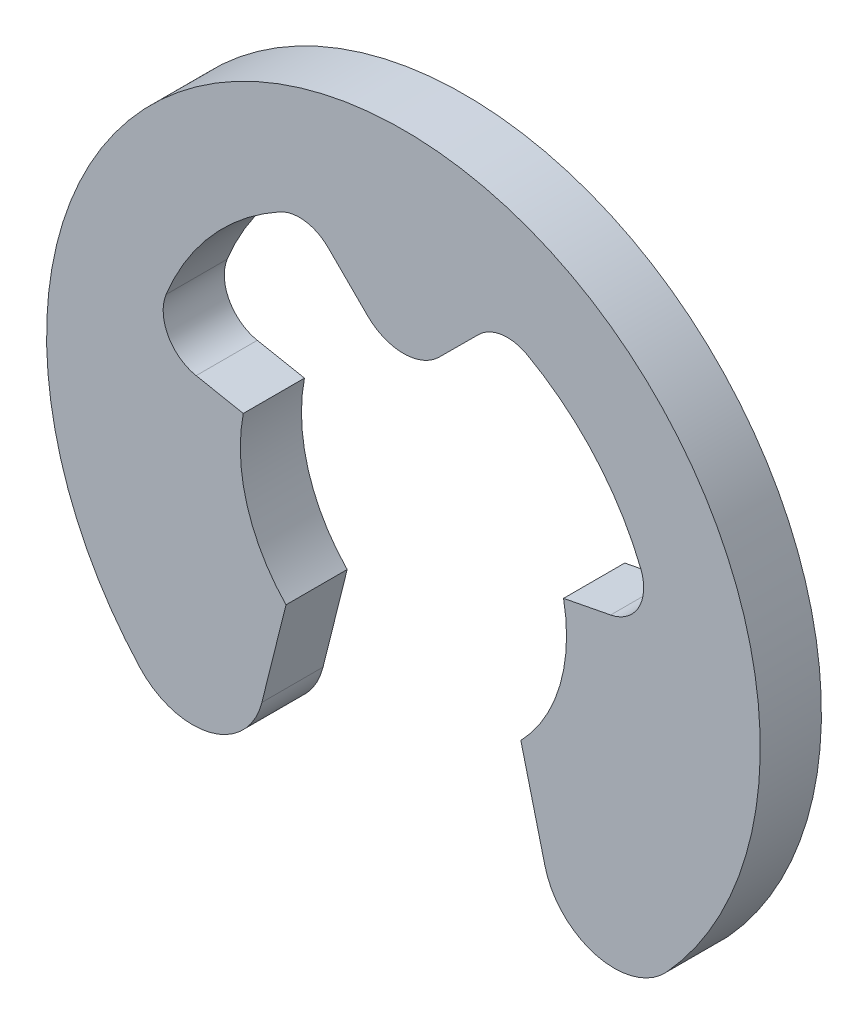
ISO-10303-21;
HEADER;
FILE_DESCRIPTION(('STEP AP214'),'2;1');
FILE_NAME('part.step','',(''),(''),'','','');
FILE_SCHEMA(('AUTOMOTIVE_DESIGN { 1 0 10303 214 1 1 1 1 }'));
ENDSEC;
DATA;
#1=APPLICATION_CONTEXT('core data for automotive mechanical design processes');
#2=APPLICATION_PROTOCOL_DEFINITION('international standard','automotive_design',2000,#1);
#3=PRODUCT_CONTEXT('',#1,'mechanical');
#4=PRODUCT('Part','Part','',(#3));
#5=PRODUCT_RELATED_PRODUCT_CATEGORY('part','',(#4));
#6=PRODUCT_DEFINITION_FORMATION('','',#4);
#7=PRODUCT_DEFINITION_CONTEXT('part definition',#1,'design');
#8=PRODUCT_DEFINITION('design','',#6,#7);
#9=PRODUCT_DEFINITION_SHAPE('','',#8);
#10=(LENGTH_UNIT() NAMED_UNIT(*) SI_UNIT(.MILLI.,.METRE.));
#11=(NAMED_UNIT(*) PLANE_ANGLE_UNIT() SI_UNIT($,.RADIAN.));
#12=(NAMED_UNIT(*) SI_UNIT($,.STERADIAN.) SOLID_ANGLE_UNIT());
#13=UNCERTAINTY_MEASURE_WITH_UNIT(LENGTH_MEASURE(1.E-05),#10,'distance_accuracy_value','');
#14=(GEOMETRIC_REPRESENTATION_CONTEXT(3) GLOBAL_UNCERTAINTY_ASSIGNED_CONTEXT((#13)) GLOBAL_UNIT_ASSIGNED_CONTEXT((#10,
#11,#12)) REPRESENTATION_CONTEXT('',''));
#15=CARTESIAN_POINT('',(0.,0.,0.));
#16=DIRECTION('',(0.,0.,1.));
#17=DIRECTION('',(1.,0.,0.));
#18=AXIS2_PLACEMENT_3D('',#15,#16,#17);
#19=CARTESIAN_POINT('',(-1.95651724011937,0.788144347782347,0.6));
#20=DIRECTION('',(0.,0.,-1.));
#21=DIRECTION('',(-1.,0.,0.));
#22=AXIS2_PLACEMENT_3D('',#19,#20,#21);
#23=CYLINDRICAL_SURFACE('',#22,0.4);
#24=CARTESIAN_POINT('',(-1.95651724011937,0.788144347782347,0.));
#25=DIRECTION('',(0.,0.,-1.));
#26=DIRECTION('',(-1.,0.,0.));
#27=AXIS2_PLACEMENT_3D('',#24,#25,#26);
#28=CIRCLE('',#27,0.4);
#29=CARTESIAN_POINT('',(-2.03290583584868,0.395506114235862,0.));
#30=VERTEX_POINT('',#29);
#31=CARTESIAN_POINT('',(-2.32754470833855,0.937605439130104,0.));
#32=VERTEX_POINT('',#31);
#33=EDGE_CURVE('E189',#30,#32,#28,.T.);
#34=ORIENTED_EDGE('',*,*,#33,.T.);
#35=DIRECTION('',(0.,0.,-1.));
#36=VECTOR('',#35,1.);
#37=CARTESIAN_POINT('',(-2.32754470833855,0.937605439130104,0.6));
#38=LINE('',#37,#36);
#39=CARTESIAN_POINT('',(-2.32754470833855,0.937605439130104,0.6));
#40=VERTEX_POINT('',#39);
#41=EDGE_CURVE('E11',#40,#32,#38,.T.);
#42=ORIENTED_EDGE('',*,*,#41,.F.);
#43=CARTESIAN_POINT('',(-1.95651724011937,0.788144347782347,0.6));
#44=DIRECTION('',(0.,0.,-1.));
#45=DIRECTION('',(-1.,0.,0.));
#46=AXIS2_PLACEMENT_3D('',#43,#44,#45);
#47=CIRCLE('',#46,0.4);
#48=CARTESIAN_POINT('',(-2.03290583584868,0.395506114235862,0.6));
#49=VERTEX_POINT('',#48);
#50=EDGE_CURVE('E223',#49,#40,#47,.T.);
#51=ORIENTED_EDGE('',*,*,#50,.F.);
#52=DIRECTION('',(0.,0.,-1.));
#53=VECTOR('',#52,1.);
#54=CARTESIAN_POINT('',(-2.03290583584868,0.395506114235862,0.6));
#55=LINE('',#54,#53);
#56=EDGE_CURVE('E185',#49,#30,#55,.T.);
#57=ORIENTED_EDGE('',*,*,#56,.T.);
#58=EDGE_LOOP('',(#34,#42,#51,#57));
#59=FACE_BOUND('',#58,.T.);
#60=ADVANCED_FACE('F33',(#59),#23,.F.);
#61=CARTESIAN_POINT('',(0.,0.,0.6));
#62=DIRECTION('',(0.,0.,-1.));
#63=DIRECTION('',(-1.,0.,0.));
#64=AXIS2_PLACEMENT_3D('',#61,#62,#63);
#65=CYLINDRICAL_SURFACE('',#64,2.50929638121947);
#66=CARTESIAN_POINT('',(0.,0.,0.));
#67=DIRECTION('',(0.,0.,-1.));
#68=DIRECTION('',(1.,0.,0.));
#69=AXIS2_PLACEMENT_3D('',#66,#67,#68);
#70=CIRCLE('',#69,2.50929638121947);
#71=CARTESIAN_POINT('',(-1.21323583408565,2.19650338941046,0.));
#72=VERTEX_POINT('',#71);
#73=EDGE_CURVE('E192',#32,#72,#70,.T.);
#74=ORIENTED_EDGE('',*,*,#73,.T.);
#75=DIRECTION('',(0.,0.,-1.));
#76=VECTOR('',#75,1.);
#77=CARTESIAN_POINT('',(-1.21323583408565,2.19650338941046,0.6));
#78=LINE('',#77,#76);
#79=CARTESIAN_POINT('',(-1.21323583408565,2.19650338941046,0.6));
#80=VERTEX_POINT('',#79);
#81=EDGE_CURVE('E41',#80,#72,#78,.T.);
#82=ORIENTED_EDGE('',*,*,#81,.F.);
#83=CARTESIAN_POINT('',(0.,0.,0.6));
#84=DIRECTION('',(0.,0.,-1.));
#85=DIRECTION('',(1.,0.,0.));
#86=AXIS2_PLACEMENT_3D('',#83,#84,#85);
#87=CIRCLE('',#86,2.50929638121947);
#88=EDGE_CURVE('E122',#40,#80,#87,.T.);
#89=ORIENTED_EDGE('',*,*,#88,.F.);
#90=ORIENTED_EDGE('',*,*,#41,.T.);
#91=EDGE_LOOP('',(#74,#82,#89,#90));
#92=FACE_BOUND('',#91,.T.);
#93=ADVANCED_FACE('F331',(#92),#65,.F.);
#94=CARTESIAN_POINT('',(-1.01983726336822,1.84636485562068,0.6));
#95=DIRECTION('',(0.,0.,-1.));
#96=DIRECTION('',(-1.,0.,0.));
#97=AXIS2_PLACEMENT_3D('',#94,#95,#96);
#98=CYLINDRICAL_SURFACE('',#97,0.4);
#99=CARTESIAN_POINT('',(-1.01983726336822,1.84636485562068,0.));
#100=DIRECTION('',(0.,0.,-1.));
#101=DIRECTION('',(1.,0.,0.));
#102=AXIS2_PLACEMENT_3D('',#99,#100,#101);
#103=CIRCLE('',#102,0.4);
#104=CARTESIAN_POINT('',(-0.737506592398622,2.12971868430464,0.));
#105=VERTEX_POINT('',#104);
#106=EDGE_CURVE('E194',#72,#105,#103,.T.);
#107=ORIENTED_EDGE('',*,*,#106,.T.);
#108=DIRECTION('',(0.,0.,-1.));
#109=VECTOR('',#108,1.);
#110=CARTESIAN_POINT('',(-0.737506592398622,2.12971868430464,0.6));
#111=LINE('',#110,#109);
#112=CARTESIAN_POINT('',(-0.737506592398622,2.12971868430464,0.6));
#113=VERTEX_POINT('',#112);
#114=EDGE_CURVE('E260',#113,#105,#111,.T.);
#115=ORIENTED_EDGE('',*,*,#114,.F.);
#116=CARTESIAN_POINT('',(-1.01983726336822,1.84636485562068,0.6));
#117=DIRECTION('',(0.,0.,-1.));
#118=DIRECTION('',(1.,0.,0.));
#119=AXIS2_PLACEMENT_3D('',#116,#117,#118);
#120=CIRCLE('',#119,0.4);
#121=EDGE_CURVE('E268',#80,#113,#120,.T.);
#122=ORIENTED_EDGE('',*,*,#121,.F.);
#123=ORIENTED_EDGE('',*,*,#81,.T.);
#124=EDGE_LOOP('',(#107,#115,#122,#123));
#125=FACE_BOUND('',#124,.T.);
#126=ADVANCED_FACE('F266',(#125),#98,.F.);
#127=CARTESIAN_POINT('',(-0.351702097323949,1.74530728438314,0.6));
#128=DIRECTION('',(0.705826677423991,0.708384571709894,0.));
#129=DIRECTION('',(-0.708384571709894,0.705826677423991,0.));
#130=AXIS2_PLACEMENT_3D('',#127,#128,#129);
#131=PLANE('',#130);
#132=DIRECTION('',(0.708384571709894,-0.70582667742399,0.));
#133=VECTOR('',#132,1.);
#134=CARTESIAN_POINT('',(-0.351702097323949,1.74530728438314,0.));
#135=LINE('',#134,#133);
#136=CARTESIAN_POINT('',(-0.351702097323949,1.74530728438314,0.));
#137=VERTEX_POINT('',#136);
#138=EDGE_CURVE('E196',#105,#137,#135,.T.);
#139=ORIENTED_EDGE('',*,*,#138,.T.);
#140=DIRECTION('',(0.,0.,-1.));
#141=VECTOR('',#140,1.);
#142=CARTESIAN_POINT('',(-0.351702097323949,1.74530728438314,0.6));
#143=LINE('',#142,#141);
#144=CARTESIAN_POINT('',(-0.351702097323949,1.74530728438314,0.6));
#145=VERTEX_POINT('',#144);
#146=EDGE_CURVE('E257',#145,#137,#143,.T.);
#147=ORIENTED_EDGE('',*,*,#146,.F.);
#148=DIRECTION('',(0.708384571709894,-0.70582667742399,0.));
#149=VECTOR('',#148,1.);
#150=CARTESIAN_POINT('',(-0.351702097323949,1.74530728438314,0.6));
#151=LINE('',#150,#149);
#152=EDGE_CURVE('E286',#113,#145,#151,.T.);
#153=ORIENTED_EDGE('',*,*,#152,.F.);
#154=ORIENTED_EDGE('',*,*,#114,.T.);
#155=EDGE_LOOP('',(#139,#147,#153,#154));
#156=FACE_BOUND('',#155,.T.);
#157=ADVANCED_FACE('F277',(#156),#131,.F.);
#158=CARTESIAN_POINT('',(0.,2.0982839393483,0.6));
#159=DIRECTION('',(0.,0.,-1.));
#160=DIRECTION('',(-1.,0.,0.));
#161=AXIS2_PLACEMENT_3D('',#158,#159,#160);
#162=CYLINDRICAL_SURFACE('',#161,0.498283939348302);
#163=CARTESIAN_POINT('',(0.,2.0982839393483,0.));
#164=DIRECTION('',(0.,0.,1.));
#165=DIRECTION('',(1.,0.,0.));
#166=AXIS2_PLACEMENT_3D('',#163,#164,#165);
#167=CIRCLE('',#166,0.498283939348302);
#168=CARTESIAN_POINT('',(0.351702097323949,1.74530728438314,0.));
#169=VERTEX_POINT('',#168);
#170=EDGE_CURVE('E198',#137,#169,#167,.T.);
#171=ORIENTED_EDGE('',*,*,#170,.T.);
#172=DIRECTION('',(0.,0.,-1.));
#173=VECTOR('',#172,1.);
#174=CARTESIAN_POINT('',(0.351702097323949,1.74530728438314,0.6));
#175=LINE('',#174,#173);
#176=CARTESIAN_POINT('',(0.351702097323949,1.74530728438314,0.6));
#177=VERTEX_POINT('',#176);
#178=EDGE_CURVE('E254',#177,#169,#175,.T.);
#179=ORIENTED_EDGE('',*,*,#178,.F.);
#180=CARTESIAN_POINT('',(0.,2.0982839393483,0.6));
#181=DIRECTION('',(0.,0.,1.));
#182=DIRECTION('',(1.,0.,0.));
#183=AXIS2_PLACEMENT_3D('',#180,#181,#182);
#184=CIRCLE('',#183,0.498283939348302);
#185=EDGE_CURVE('E283',#145,#177,#184,.T.);
#186=ORIENTED_EDGE('',*,*,#185,.F.);
#187=ORIENTED_EDGE('',*,*,#146,.T.);
#188=EDGE_LOOP('',(#171,#179,#186,#187));
#189=FACE_BOUND('',#188,.T.);
#190=ADVANCED_FACE('F281',(#189),#162,.T.);
#191=CARTESIAN_POINT('',(0.351702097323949,1.74530728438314,0.6));
#192=DIRECTION('',(-0.705826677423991,0.708384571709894,0.));
#193=DIRECTION('',(-0.708384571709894,-0.705826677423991,0.));
#194=AXIS2_PLACEMENT_3D('',#191,#192,#193);
#195=PLANE('',#194);
#196=DIRECTION('',(0.708384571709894,0.70582667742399,0.));
#197=VECTOR('',#196,1.);
#198=CARTESIAN_POINT('',(0.351702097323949,1.74530728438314,0.));
#199=LINE('',#198,#197);
#200=CARTESIAN_POINT('',(0.737506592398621,2.12971868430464,0.));
#201=VERTEX_POINT('',#200);
#202=EDGE_CURVE('E200',#169,#201,#199,.T.);
#203=ORIENTED_EDGE('',*,*,#202,.T.);
#204=DIRECTION('',(0.,0.,-1.));
#205=VECTOR('',#204,1.);
#206=CARTESIAN_POINT('',(0.737506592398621,2.12971868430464,0.6));
#207=LINE('',#206,#205);
#208=CARTESIAN_POINT('',(0.737506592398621,2.12971868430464,0.6));
#209=VERTEX_POINT('',#208);
#210=EDGE_CURVE('E251',#209,#201,#207,.T.);
#211=ORIENTED_EDGE('',*,*,#210,.F.);
#212=DIRECTION('',(0.708384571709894,0.70582667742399,0.));
#213=VECTOR('',#212,1.);
#214=CARTESIAN_POINT('',(0.351702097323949,1.74530728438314,0.6));
#215=LINE('',#214,#213);
#216=EDGE_CURVE('E285',#177,#209,#215,.T.);
#217=ORIENTED_EDGE('',*,*,#216,.F.);
#218=ORIENTED_EDGE('',*,*,#178,.T.);
#219=EDGE_LOOP('',(#203,#211,#217,#218));
#220=FACE_BOUND('',#219,.T.);
#221=ADVANCED_FACE('F344',(#220),#195,.F.);
#222=CARTESIAN_POINT('',(1.01983726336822,1.84636485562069,0.6));
#223=DIRECTION('',(0.,0.,-1.));
#224=DIRECTION('',(-1.,0.,0.));
#225=AXIS2_PLACEMENT_3D('',#222,#223,#224);
#226=CYLINDRICAL_SURFACE('',#225,0.4);
#227=CARTESIAN_POINT('',(1.01983726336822,1.84636485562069,0.));
#228=DIRECTION('',(0.,0.,-1.));
#229=DIRECTION('',(-1.,0.,0.));
#230=AXIS2_PLACEMENT_3D('',#227,#228,#229);
#231=CIRCLE('',#230,0.4);
#232=CARTESIAN_POINT('',(1.21323583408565,2.19650338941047,0.));
#233=VERTEX_POINT('',#232);
#234=EDGE_CURVE('E202',#201,#233,#231,.T.);
#235=ORIENTED_EDGE('',*,*,#234,.T.);
#236=DIRECTION('',(0.,0.,-1.));
#237=VECTOR('',#236,1.);
#238=CARTESIAN_POINT('',(1.21323583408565,2.19650338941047,0.6));
#239=LINE('',#238,#237);
#240=CARTESIAN_POINT('',(1.21323583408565,2.19650338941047,0.6));
#241=VERTEX_POINT('',#240);
#242=EDGE_CURVE('E248',#241,#233,#239,.T.);
#243=ORIENTED_EDGE('',*,*,#242,.F.);
#244=CARTESIAN_POINT('',(1.01983726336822,1.84636485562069,0.6));
#245=DIRECTION('',(0.,0.,-1.));
#246=DIRECTION('',(-1.,0.,0.));
#247=AXIS2_PLACEMENT_3D('',#244,#245,#246);
#248=CIRCLE('',#247,0.4);
#249=EDGE_CURVE('E288',#209,#241,#248,.T.);
#250=ORIENTED_EDGE('',*,*,#249,.F.);
#251=ORIENTED_EDGE('',*,*,#210,.T.);
#252=EDGE_LOOP('',(#235,#243,#250,#251));
#253=FACE_BOUND('',#252,.T.);
#254=ADVANCED_FACE('F347',(#253),#226,.F.);
#255=CARTESIAN_POINT('',(0.,0.,0.6));
#256=DIRECTION('',(0.,0.,-1.));
#257=DIRECTION('',(-1.,0.,0.));
#258=AXIS2_PLACEMENT_3D('',#255,#256,#257);
#259=CYLINDRICAL_SURFACE('',#258,2.50929638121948);
#260=CARTESIAN_POINT('',(0.,0.,0.));
#261=DIRECTION('',(0.,0.,-1.));
#262=DIRECTION('',(-1.,0.,0.));
#263=AXIS2_PLACEMENT_3D('',#260,#261,#262);
#264=CIRCLE('',#263,2.50929638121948);
#265=CARTESIAN_POINT('',(2.32754470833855,0.937605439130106,0.));
#266=VERTEX_POINT('',#265);
#267=EDGE_CURVE('E204',#233,#266,#264,.T.);
#268=ORIENTED_EDGE('',*,*,#267,.T.);
#269=DIRECTION('',(0.,0.,-1.));
#270=VECTOR('',#269,1.);
#271=CARTESIAN_POINT('',(2.32754470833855,0.937605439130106,0.6));
#272=LINE('',#271,#270);
#273=CARTESIAN_POINT('',(2.32754470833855,0.937605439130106,0.6));
#274=VERTEX_POINT('',#273);
#275=EDGE_CURVE('E245',#274,#266,#272,.T.);
#276=ORIENTED_EDGE('',*,*,#275,.F.);
#277=CARTESIAN_POINT('',(0.,0.,0.6));
#278=DIRECTION('',(0.,0.,-1.));
#279=DIRECTION('',(-1.,0.,0.));
#280=AXIS2_PLACEMENT_3D('',#277,#278,#279);
#281=CIRCLE('',#280,2.50929638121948);
#282=EDGE_CURVE('E294',#241,#274,#281,.T.);
#283=ORIENTED_EDGE('',*,*,#282,.F.);
#284=ORIENTED_EDGE('',*,*,#242,.T.);
#285=EDGE_LOOP('',(#268,#276,#283,#284));
#286=FACE_BOUND('',#285,.T.);
#287=ADVANCED_FACE('F351',(#286),#259,.F.);
#288=CARTESIAN_POINT('',(1.95651724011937,0.788144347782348,0.6));
#289=DIRECTION('',(0.,0.,-1.));
#290=DIRECTION('',(-1.,0.,0.));
#291=AXIS2_PLACEMENT_3D('',#288,#289,#290);
#292=CYLINDRICAL_SURFACE('',#291,0.4);
#293=CARTESIAN_POINT('',(1.95651724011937,0.788144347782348,0.));
#294=DIRECTION('',(0.,0.,-1.));
#295=DIRECTION('',(1.,0.,0.));
#296=AXIS2_PLACEMENT_3D('',#293,#294,#295);
#297=CIRCLE('',#296,0.4);
#298=CARTESIAN_POINT('',(2.03290583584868,0.395506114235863,0.));
#299=VERTEX_POINT('',#298);
#300=EDGE_CURVE('E206',#266,#299,#297,.T.);
#301=ORIENTED_EDGE('',*,*,#300,.T.);
#302=DIRECTION('',(0.,0.,-1.));
#303=VECTOR('',#302,1.);
#304=CARTESIAN_POINT('',(2.03290583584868,0.395506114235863,0.6));
#305=LINE('',#304,#303);
#306=CARTESIAN_POINT('',(2.03290583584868,0.395506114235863,0.6));
#307=VERTEX_POINT('',#306);
#308=EDGE_CURVE('E242',#307,#299,#305,.T.);
#309=ORIENTED_EDGE('',*,*,#308,.F.);
#310=CARTESIAN_POINT('',(1.95651724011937,0.788144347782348,0.6));
#311=DIRECTION('',(0.,0.,-1.));
#312=DIRECTION('',(1.,0.,0.));
#313=AXIS2_PLACEMENT_3D('',#310,#311,#312);
#314=CIRCLE('',#313,0.4);
#315=EDGE_CURVE('E296',#274,#307,#314,.T.);
#316=ORIENTED_EDGE('',*,*,#315,.F.);
#317=ORIENTED_EDGE('',*,*,#275,.T.);
#318=EDGE_LOOP('',(#301,#309,#316,#317));
#319=FACE_BOUND('',#318,.T.);
#320=ADVANCED_FACE('F355',(#319),#292,.F.);
#321=CARTESIAN_POINT('',(1.57055293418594,0.305554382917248,0.6));
#322=DIRECTION('',(0.190971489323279,-0.981595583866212,0.));
#323=DIRECTION('',(0.981595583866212,0.190971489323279,0.));
#324=AXIS2_PLACEMENT_3D('',#321,#322,#323);
#325=PLANE('',#324);
#326=DIRECTION('',(-0.981595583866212,-0.190971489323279,0.));
#327=VECTOR('',#326,1.);
#328=CARTESIAN_POINT('',(1.57055293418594,0.305554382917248,0.));
#329=LINE('',#328,#327);
#330=CARTESIAN_POINT('',(1.57055293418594,0.305554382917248,0.));
#331=VERTEX_POINT('',#330);
#332=EDGE_CURVE('E208',#299,#331,#329,.T.);
#333=ORIENTED_EDGE('',*,*,#332,.T.);
#334=DIRECTION('',(0.,0.,-1.));
#335=VECTOR('',#334,1.);
#336=CARTESIAN_POINT('',(1.57055293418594,0.305554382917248,0.6));
#337=LINE('',#336,#335);
#338=CARTESIAN_POINT('',(1.57055293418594,0.305554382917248,0.6));
#339=VERTEX_POINT('',#338);
#340=EDGE_CURVE('E239',#339,#331,#337,.T.);
#341=ORIENTED_EDGE('',*,*,#340,.F.);
#342=DIRECTION('',(-0.981595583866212,-0.190971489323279,0.));
#343=VECTOR('',#342,1.);
#344=CARTESIAN_POINT('',(1.57055293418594,0.305554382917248,0.6));
#345=LINE('',#344,#343);
#346=EDGE_CURVE('E298',#307,#339,#345,.T.);
#347=ORIENTED_EDGE('',*,*,#346,.F.);
#348=ORIENTED_EDGE('',*,*,#308,.T.);
#349=EDGE_LOOP('',(#333,#341,#347,#348));
#350=FACE_BOUND('',#349,.T.);
#351=ADVANCED_FACE('F359',(#350),#325,.F.);
#352=CARTESIAN_POINT('',(0.,0.,0.6));
#353=DIRECTION('',(0.,0.,-1.));
#354=DIRECTION('',(-1.,0.,0.));
#355=AXIS2_PLACEMENT_3D('',#352,#353,#354);
#356=CYLINDRICAL_SURFACE('',#355,1.6);
#357=CARTESIAN_POINT('',(0.,0.,0.));
#358=DIRECTION('',(0.,0.,-1.));
#359=DIRECTION('',(-1.,0.,0.));
#360=AXIS2_PLACEMENT_3D('',#357,#358,#359);
#361=CIRCLE('',#360,1.6);
#362=CARTESIAN_POINT('',(1.15166914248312,-1.11070166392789,0.));
#363=VERTEX_POINT('',#362);
#364=EDGE_CURVE('E210',#331,#363,#361,.T.);
#365=ORIENTED_EDGE('',*,*,#364,.T.);
#366=DIRECTION('',(0.,0.,-1.));
#367=VECTOR('',#366,1.);
#368=CARTESIAN_POINT('',(1.15166914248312,-1.11070166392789,0.6));
#369=LINE('',#368,#367);
#370=CARTESIAN_POINT('',(1.15166914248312,-1.11070166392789,0.6));
#371=VERTEX_POINT('',#370);
#372=EDGE_CURVE('E236',#371,#363,#369,.T.);
#373=ORIENTED_EDGE('',*,*,#372,.F.);
#374=CARTESIAN_POINT('',(0.,0.,0.6));
#375=DIRECTION('',(0.,0.,-1.));
#376=DIRECTION('',(-1.,0.,0.));
#377=AXIS2_PLACEMENT_3D('',#374,#375,#376);
#378=CIRCLE('',#377,1.6);
#379=EDGE_CURVE('E300',#339,#371,#378,.T.);
#380=ORIENTED_EDGE('',*,*,#379,.F.);
#381=ORIENTED_EDGE('',*,*,#340,.T.);
#382=EDGE_LOOP('',(#365,#373,#380,#381));
#383=FACE_BOUND('',#382,.T.);
#384=ADVANCED_FACE('F363',(#383),#356,.F.);
#385=CARTESIAN_POINT('',(1.15166914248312,-1.11070166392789,0.6));
#386=DIRECTION('',(0.970192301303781,0.24233633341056,0.));
#387=DIRECTION('',(-0.24233633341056,0.970192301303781,0.));
#388=AXIS2_PLACEMENT_3D('',#385,#386,#387);
#389=PLANE('',#388);
#390=DIRECTION('',(0.24233633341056,-0.970192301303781,0.));
#391=VECTOR('',#390,1.);
#392=CARTESIAN_POINT('',(1.15166914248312,-1.11070166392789,0.));
#393=LINE('',#392,#391);
#394=CARTESIAN_POINT('',(1.38827904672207,-2.05796823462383,0.));
#395=VERTEX_POINT('',#394);
#396=EDGE_CURVE('E212',#363,#395,#393,.T.);
#397=ORIENTED_EDGE('',*,*,#396,.T.);
#398=DIRECTION('',(0.,0.,-1.));
#399=VECTOR('',#398,1.);
#400=CARTESIAN_POINT('',(1.38827904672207,-2.05796823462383,0.6));
#401=LINE('',#400,#399);
#402=CARTESIAN_POINT('',(1.38827904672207,-2.05796823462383,0.6));
#403=VERTEX_POINT('',#402);
#404=EDGE_CURVE('E233',#403,#395,#401,.T.);
#405=ORIENTED_EDGE('',*,*,#404,.F.);
#406=DIRECTION('',(0.24233633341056,-0.970192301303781,0.));
#407=VECTOR('',#406,1.);
#408=CARTESIAN_POINT('',(1.15166914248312,-1.11070166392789,0.6));
#409=LINE('',#408,#407);
#410=EDGE_CURVE('E302',#371,#403,#409,.T.);
#411=ORIENTED_EDGE('',*,*,#410,.F.);
#412=ORIENTED_EDGE('',*,*,#372,.T.);
#413=EDGE_LOOP('',(#397,#405,#411,#412));
#414=FACE_BOUND('',#413,.T.);
#415=ADVANCED_FACE('F367',(#414),#389,.F.);
#416=CARTESIAN_POINT('',(2.06741365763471,-1.88833280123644,0.6));
#417=DIRECTION('',(0.,0.,-1.));
#418=DIRECTION('',(-1.,0.,0.));
#419=AXIS2_PLACEMENT_3D('',#416,#417,#418);
#420=CYLINDRICAL_SURFACE('',#419,0.7);
#421=CARTESIAN_POINT('',(2.06741365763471,-1.88833280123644,0.));
#422=DIRECTION('',(0.,0.,1.));
#423=DIRECTION('',(-1.,0.,0.));
#424=AXIS2_PLACEMENT_3D('',#421,#422,#423);
#425=CIRCLE('',#424,0.7);
#426=CARTESIAN_POINT('',(2.58426707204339,-2.36041600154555,0.));
#427=VERTEX_POINT('',#426);
#428=EDGE_CURVE('E214',#395,#427,#425,.T.);
#429=ORIENTED_EDGE('',*,*,#428,.T.);
#430=DIRECTION('',(0.,0.,-1.));
#431=VECTOR('',#430,1.);
#432=CARTESIAN_POINT('',(2.58426707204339,-2.36041600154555,0.6));
#433=LINE('',#432,#431);
#434=CARTESIAN_POINT('',(2.58426707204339,-2.36041600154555,0.6));
#435=VERTEX_POINT('',#434);
#436=EDGE_CURVE('E230',#435,#427,#433,.T.);
#437=ORIENTED_EDGE('',*,*,#436,.F.);
#438=CARTESIAN_POINT('',(2.06741365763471,-1.88833280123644,0.6));
#439=DIRECTION('',(0.,0.,1.));
#440=DIRECTION('',(-1.,0.,0.));
#441=AXIS2_PLACEMENT_3D('',#438,#439,#440);
#442=CIRCLE('',#441,0.7);
#443=EDGE_CURVE('E304',#403,#435,#442,.T.);
#444=ORIENTED_EDGE('',*,*,#443,.F.);
#445=ORIENTED_EDGE('',*,*,#404,.T.);
#446=EDGE_LOOP('',(#429,#437,#444,#445));
#447=FACE_BOUND('',#446,.T.);
#448=ADVANCED_FACE('F371',(#447),#420,.T.);
#449=CARTESIAN_POINT('',(0.,0.,0.6));
#450=DIRECTION('',(0.,0.,-1.));
#451=DIRECTION('',(-1.,0.,0.));
#452=AXIS2_PLACEMENT_3D('',#449,#450,#451);
#453=CYLINDRICAL_SURFACE('',#452,3.5);
#454=CARTESIAN_POINT('',(0.,0.,0.));
#455=DIRECTION('',(0.,0.,1.));
#456=DIRECTION('',(1.,0.,0.));
#457=AXIS2_PLACEMENT_3D('',#454,#455,#456);
#458=CIRCLE('',#457,3.5);
#459=CARTESIAN_POINT('',(-2.58426707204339,-2.36041600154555,0.));
#460=VERTEX_POINT('',#459);
#461=EDGE_CURVE('E216',#427,#460,#458,.T.);
#462=ORIENTED_EDGE('',*,*,#461,.T.);
#463=DIRECTION('',(0.,0.,-1.));
#464=VECTOR('',#463,1.);
#465=CARTESIAN_POINT('',(-2.58426707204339,-2.36041600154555,0.6));
#466=LINE('',#465,#464);
#467=CARTESIAN_POINT('',(-2.58426707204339,-2.36041600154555,0.6));
#468=VERTEX_POINT('',#467);
#469=EDGE_CURVE('E227',#468,#460,#466,.T.);
#470=ORIENTED_EDGE('',*,*,#469,.F.);
#471=CARTESIAN_POINT('',(0.,0.,0.6));
#472=DIRECTION('',(0.,0.,1.));
#473=DIRECTION('',(1.,0.,0.));
#474=AXIS2_PLACEMENT_3D('',#471,#472,#473);
#475=CIRCLE('',#474,3.5);
#476=EDGE_CURVE('E306',#435,#468,#475,.T.);
#477=ORIENTED_EDGE('',*,*,#476,.F.);
#478=ORIENTED_EDGE('',*,*,#436,.T.);
#479=EDGE_LOOP('',(#462,#470,#477,#478));
#480=FACE_BOUND('',#479,.T.);
#481=ADVANCED_FACE('F312',(#480),#453,.T.);
#482=CARTESIAN_POINT('',(-2.06741365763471,-1.88833280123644,0.6));
#483=DIRECTION('',(0.,0.,-1.));
#484=DIRECTION('',(-1.,0.,0.));
#485=AXIS2_PLACEMENT_3D('',#482,#483,#484);
#486=CYLINDRICAL_SURFACE('',#485,0.7);
#487=CARTESIAN_POINT('',(-2.06741365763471,-1.88833280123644,0.));
#488=DIRECTION('',(0.,0.,1.));
#489=DIRECTION('',(1.,0.,0.));
#490=AXIS2_PLACEMENT_3D('',#487,#488,#489);
#491=CIRCLE('',#490,0.7);
#492=CARTESIAN_POINT('',(-1.38827904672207,-2.05796823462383,0.));
#493=VERTEX_POINT('',#492);
#494=EDGE_CURVE('E218',#460,#493,#491,.T.);
#495=ORIENTED_EDGE('',*,*,#494,.T.);
#496=DIRECTION('',(0.,0.,-1.));
#497=VECTOR('',#496,1.);
#498=CARTESIAN_POINT('',(-1.38827904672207,-2.05796823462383,0.6));
#499=LINE('',#498,#497);
#500=CARTESIAN_POINT('',(-1.38827904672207,-2.05796823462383,0.6));
#501=VERTEX_POINT('',#500);
#502=EDGE_CURVE('E180',#501,#493,#499,.T.);
#503=ORIENTED_EDGE('',*,*,#502,.F.);
#504=CARTESIAN_POINT('',(-2.06741365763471,-1.88833280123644,0.6));
#505=DIRECTION('',(0.,0.,1.));
#506=DIRECTION('',(1.,0.,0.));
#507=AXIS2_PLACEMENT_3D('',#504,#505,#506);
#508=CIRCLE('',#507,0.7);
#509=EDGE_CURVE('E171',#468,#501,#508,.T.);
#510=ORIENTED_EDGE('',*,*,#509,.F.);
#511=ORIENTED_EDGE('',*,*,#469,.T.);
#512=EDGE_LOOP('',(#495,#503,#510,#511));
#513=FACE_BOUND('',#512,.T.);
#514=ADVANCED_FACE('F316',(#513),#486,.T.);
#515=CARTESIAN_POINT('',(-1.15166914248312,-1.11070166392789,0.6));
#516=DIRECTION('',(-0.970192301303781,0.24233633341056,0.));
#517=DIRECTION('',(-0.24233633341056,-0.970192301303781,0.));
#518=AXIS2_PLACEMENT_3D('',#515,#516,#517);
#519=PLANE('',#518);
#520=DIRECTION('',(0.24233633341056,0.970192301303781,0.));
#521=VECTOR('',#520,1.);
#522=CARTESIAN_POINT('',(-1.15166914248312,-1.11070166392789,0.));
#523=LINE('',#522,#521);
#524=CARTESIAN_POINT('',(-1.15166914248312,-1.11070166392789,0.));
#525=VERTEX_POINT('',#524);
#526=EDGE_CURVE('E179',#493,#525,#523,.T.);
#527=ORIENTED_EDGE('',*,*,#526,.T.);
#528=DIRECTION('',(0.,0.,-1.));
#529=VECTOR('',#528,1.);
#530=CARTESIAN_POINT('',(-1.15166914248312,-1.11070166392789,0.6));
#531=LINE('',#530,#529);
#532=CARTESIAN_POINT('',(-1.15166914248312,-1.11070166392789,0.6));
#533=VERTEX_POINT('',#532);
#534=EDGE_CURVE('E176',#533,#525,#531,.T.);
#535=ORIENTED_EDGE('',*,*,#534,.F.);
#536=DIRECTION('',(0.24233633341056,0.970192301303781,0.));
#537=VECTOR('',#536,1.);
#538=CARTESIAN_POINT('',(-1.15166914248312,-1.11070166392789,0.6));
#539=LINE('',#538,#537);
#540=EDGE_CURVE('E165',#501,#533,#539,.T.);
#541=ORIENTED_EDGE('',*,*,#540,.F.);
#542=ORIENTED_EDGE('',*,*,#502,.T.);
#543=EDGE_LOOP('',(#527,#535,#541,#542));
#544=FACE_BOUND('',#543,.T.);
#545=ADVANCED_FACE('F177',(#544),#519,.F.);
#546=CARTESIAN_POINT('',(0.,0.,0.6));
#547=DIRECTION('',(0.,0.,-1.));
#548=DIRECTION('',(-1.,0.,0.));
#549=AXIS2_PLACEMENT_3D('',#546,#547,#548);
#550=CYLINDRICAL_SURFACE('',#549,1.6);
#551=CARTESIAN_POINT('',(0.,0.,0.));
#552=DIRECTION('',(0.,0.,-1.));
#553=DIRECTION('',(1.,0.,0.));
#554=AXIS2_PLACEMENT_3D('',#551,#552,#553);
#555=CIRCLE('',#554,1.6);
#556=CARTESIAN_POINT('',(-1.57055293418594,0.305554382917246,0.));
#557=VERTEX_POINT('',#556);
#558=EDGE_CURVE('E108',#525,#557,#555,.T.);
#559=ORIENTED_EDGE('',*,*,#558,.T.);
#560=DIRECTION('',(0.,0.,-1.));
#561=VECTOR('',#560,1.);
#562=CARTESIAN_POINT('',(-1.57055293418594,0.305554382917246,0.6));
#563=LINE('',#562,#561);
#564=CARTESIAN_POINT('',(-1.57055293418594,0.305554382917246,0.6));
#565=VERTEX_POINT('',#564);
#566=EDGE_CURVE('E181',#565,#557,#563,.T.);
#567=ORIENTED_EDGE('',*,*,#566,.F.);
#568=CARTESIAN_POINT('',(0.,0.,0.6));
#569=DIRECTION('',(0.,0.,-1.));
#570=DIRECTION('',(1.,0.,0.));
#571=AXIS2_PLACEMENT_3D('',#568,#569,#570);
#572=CIRCLE('',#571,1.6);
#573=EDGE_CURVE('E169',#533,#565,#572,.T.);
#574=ORIENTED_EDGE('',*,*,#573,.F.);
#575=ORIENTED_EDGE('',*,*,#534,.T.);
#576=EDGE_LOOP('',(#559,#567,#574,#575));
#577=FACE_BOUND('',#576,.T.);
#578=ADVANCED_FACE('F183',(#577),#550,.F.);
#579=CARTESIAN_POINT('',(-1.57055293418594,0.305554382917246,0.6));
#580=DIRECTION('',(-0.190971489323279,-0.981595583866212,0.));
#581=DIRECTION('',(0.981595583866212,-0.190971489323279,0.));
#582=AXIS2_PLACEMENT_3D('',#579,#580,#581);
#583=PLANE('',#582);
#584=DIRECTION('',(-0.981595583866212,0.190971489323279,0.));
#585=VECTOR('',#584,1.);
#586=CARTESIAN_POINT('',(-1.57055293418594,0.305554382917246,0.));
#587=LINE('',#586,#585);
#588=EDGE_CURVE('E114',#557,#30,#587,.T.);
#589=ORIENTED_EDGE('',*,*,#588,.T.);
#590=ORIENTED_EDGE('',*,*,#56,.F.);
#591=DIRECTION('',(-0.981595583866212,0.190971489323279,0.));
#592=VECTOR('',#591,1.);
#593=CARTESIAN_POINT('',(-1.57055293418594,0.305554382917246,0.6));
#594=LINE('',#593,#592);
#595=EDGE_CURVE('E49',#565,#49,#594,.T.);
#596=ORIENTED_EDGE('',*,*,#595,.F.);
#597=ORIENTED_EDGE('',*,*,#566,.T.);
#598=EDGE_LOOP('',(#589,#590,#596,#597));
#599=FACE_BOUND('',#598,.T.);
#600=ADVANCED_FACE('F320',(#599),#583,.F.);
#601=CARTESIAN_POINT('',(-1.95651724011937,0.788144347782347,0.6));
#602=DIRECTION('',(0.,0.,-1.));
#603=DIRECTION('',(-1.,0.,0.));
#604=AXIS2_PLACEMENT_3D('',#601,#602,#603);
#605=PLANE('',#604);
#606=ORIENTED_EDGE('',*,*,#50,.T.);
#607=ORIENTED_EDGE('',*,*,#88,.T.);
#608=ORIENTED_EDGE('',*,*,#121,.T.);
#609=ORIENTED_EDGE('',*,*,#152,.T.);
#610=ORIENTED_EDGE('',*,*,#185,.T.);
#611=ORIENTED_EDGE('',*,*,#216,.T.);
#612=ORIENTED_EDGE('',*,*,#249,.T.);
#613=ORIENTED_EDGE('',*,*,#282,.T.);
#614=ORIENTED_EDGE('',*,*,#315,.T.);
#615=ORIENTED_EDGE('',*,*,#346,.T.);
#616=ORIENTED_EDGE('',*,*,#379,.T.);
#617=ORIENTED_EDGE('',*,*,#410,.T.);
#618=ORIENTED_EDGE('',*,*,#443,.T.);
#619=ORIENTED_EDGE('',*,*,#476,.T.);
#620=ORIENTED_EDGE('',*,*,#509,.T.);
#621=ORIENTED_EDGE('',*,*,#540,.T.);
#622=ORIENTED_EDGE('',*,*,#573,.T.);
#623=ORIENTED_EDGE('',*,*,#595,.T.);
#624=EDGE_LOOP('',(#606,#607,#608,#609,#610,#611,#612,#613,#614,#615,#616,#617,#618,#619,#620,
#621,#622,#623));
#625=FACE_BOUND('',#624,.T.);
#626=ADVANCED_FACE('F167',(#625),#605,.F.);
#627=CARTESIAN_POINT('',(-1.95651724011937,0.788144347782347,0.));
#628=DIRECTION('',(0.,0.,-1.));
#629=DIRECTION('',(-1.,0.,0.));
#630=AXIS2_PLACEMENT_3D('',#627,#628,#629);
#631=PLANE('',#630);
#632=ORIENTED_EDGE('',*,*,#33,.F.);
#633=ORIENTED_EDGE('',*,*,#588,.F.);
#634=ORIENTED_EDGE('',*,*,#558,.F.);
#635=ORIENTED_EDGE('',*,*,#526,.F.);
#636=ORIENTED_EDGE('',*,*,#494,.F.);
#637=ORIENTED_EDGE('',*,*,#461,.F.);
#638=ORIENTED_EDGE('',*,*,#428,.F.);
#639=ORIENTED_EDGE('',*,*,#396,.F.);
#640=ORIENTED_EDGE('',*,*,#364,.F.);
#641=ORIENTED_EDGE('',*,*,#332,.F.);
#642=ORIENTED_EDGE('',*,*,#300,.F.);
#643=ORIENTED_EDGE('',*,*,#267,.F.);
#644=ORIENTED_EDGE('',*,*,#234,.F.);
#645=ORIENTED_EDGE('',*,*,#202,.F.);
#646=ORIENTED_EDGE('',*,*,#170,.F.);
#647=ORIENTED_EDGE('',*,*,#138,.F.);
#648=ORIENTED_EDGE('',*,*,#106,.F.);
#649=ORIENTED_EDGE('',*,*,#73,.F.);
#650=EDGE_LOOP('',(#632,#633,#634,#635,#636,#637,#638,#639,#640,#641,#642,#643,#644,#645,#646,
#647,#648,#649));
#651=FACE_BOUND('',#650,.T.);
#652=ADVANCED_FACE('F272',(#651),#631,.T.);
#653=CLOSED_SHELL('',(#60,#93,#126,#157,#190,#221,#254,#287,#320,#351,#384,#415,#448,#481,#514,
#545,#578,#600,#626,#652));
#654=MANIFOLD_SOLID_BREP('B2',#653);
#655=ADVANCED_BREP_SHAPE_REPRESENTATION('',(#18,#654),#14);
#656=SHAPE_DEFINITION_REPRESENTATION(#9,#655);
ENDSEC;
END-ISO-10303-21;
